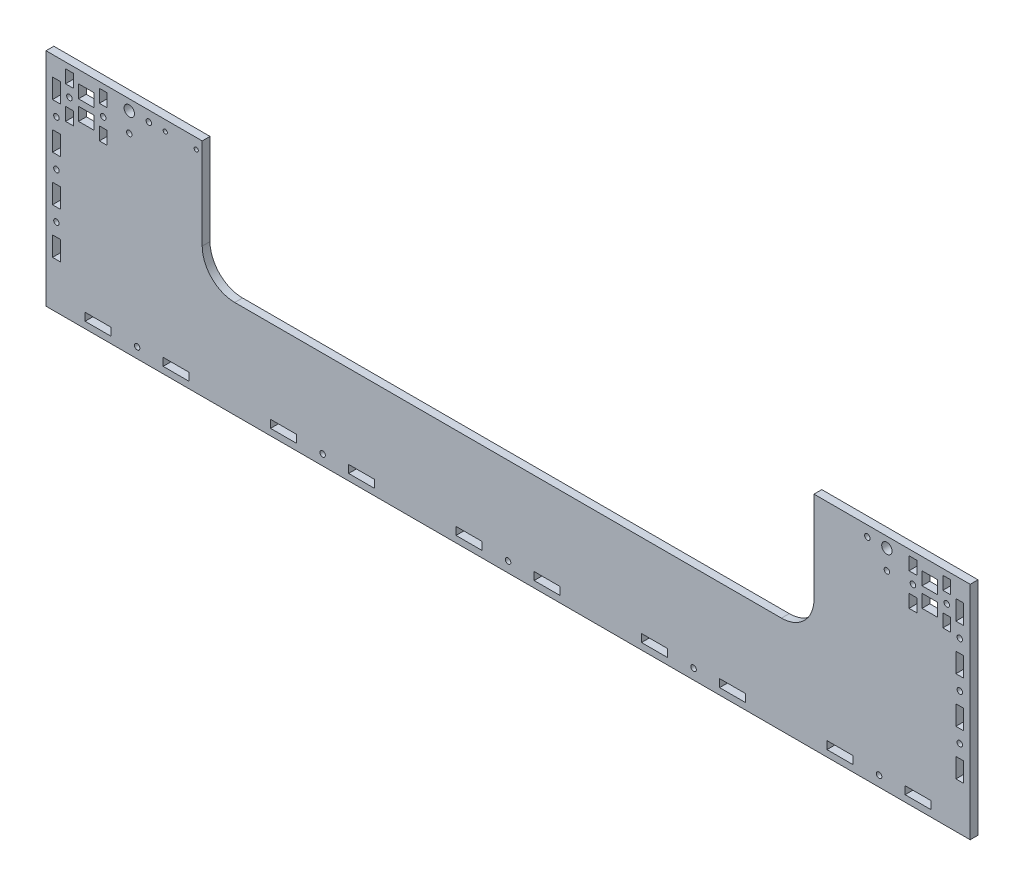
from build123d import *

# Parameters (mm, degrees)
SKETCH_2_W          = 710
SKETCH_2_H          = 170
SKETCH_2_R          = 2.1
SKETCH_2_W_2        = 6
SKETCH_2_H_2        = 15
EXTRUDE_1_DEPTH     = 6
SKETCH_3_R          = 2.1
SKETCH_3_W          = 20
SKETCH_3_H          = 6
CUT_EXTRUDE_1_DEPTH = 394.650860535
SKETCH_4_R          = 4
SKETCH_4_R_2        = 2.1
CUT_EXTRUDE_2_DEPTH = 394.650860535
CUT_EXTRUDE_3_DEPTH = 394.650860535
SKETCH_6_R          = 2.1
SKETCH_6_W          = 12
SKETCH_6_H          = 10
SKETCH_6_W_2        = 6
CUT_EXTRUDE_4_DEPTH = 394.650860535
SKETCH_7_R          = 1.6
CUT_EXTRUDE_5_DEPTH = 394.650860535


with BuildPart() as part:
    # Sketch 2 → Extrude 1 (new body)
    with BuildSketch(Plane.XY):
        with Locations((0, 85)):
            Rectangle(SKETCH_2_W, SKETCH_2_H)
        with Locations((-347, 130)):
            Circle(SKETCH_2_R, mode=Mode.SUBTRACT)
        with Locations((-347, 95)):
            Circle(SKETCH_2_R, mode=Mode.SUBTRACT)
        with Locations((-347, 60)):
            Circle(SKETCH_2_R, mode=Mode.SUBTRACT)
        with Locations(Location((347, 60, 0), (0, 0, 180))):
            Circle(SKETCH_2_R, mode=Mode.SUBTRACT)
        with Locations(Location((347, 95, 0), (0, 0, 180))):
            Circle(SKETCH_2_R, mode=Mode.SUBTRACT)
        with Locations(Location((347, 130, 0), (0, 0, 180))):
            Circle(SKETCH_2_R, mode=Mode.SUBTRACT)
        with Locations((347, 42.5)):
            Rectangle(SKETCH_2_W_2, SKETCH_2_H_2, mode=Mode.SUBTRACT)
        with Locations((-347, 147.5)):
            Rectangle(SKETCH_2_W_2, SKETCH_2_H_2, mode=Mode.SUBTRACT)
        with Locations((-347, 112.5)):
            Rectangle(SKETCH_2_W_2, SKETCH_2_H_2, mode=Mode.SUBTRACT)
        with Locations((-347, 77.5)):
            Rectangle(SKETCH_2_W_2, SKETCH_2_H_2, mode=Mode.SUBTRACT)
        with Locations((-347, 42.5)):
            Rectangle(SKETCH_2_W_2, SKETCH_2_H_2, mode=Mode.SUBTRACT)
        with Locations((347, 77.5)):
            Rectangle(SKETCH_2_W_2, SKETCH_2_H_2, mode=Mode.SUBTRACT)
        with Locations((347, 112.5)):
            Rectangle(SKETCH_2_W_2, SKETCH_2_H_2, mode=Mode.SUBTRACT)
        with Locations((347, 147.5)):
            Rectangle(SKETCH_2_W_2, SKETCH_2_H_2, mode=Mode.SUBTRACT)
    extrude(amount=EXTRUDE_1_DEPTH)

    # Sketch 3 → Cut-Extrude 1 (cut, through all)
    with BuildSketch(Plane.XY.offset(6)):
        with Locations((-285, 8)):
            Circle(SKETCH_3_R)
        with Locations((-142.5, 8)):
            Circle(SKETCH_3_R)
        with Locations((0, 8)):
            Circle(SKETCH_3_R)
        with Locations(Location((142.5, 8, 0), (0, 0, 180))):
            Circle(SKETCH_3_R)
        with Locations(Location((285, 8, 0), (0, 0, 180))):
            Circle(SKETCH_3_R)
        with Locations((-315, 8)):
            Rectangle(SKETCH_3_W, SKETCH_3_H)
        with Locations((-255, 8)):
            Rectangle(SKETCH_3_W, SKETCH_3_H)
        with Locations((-172.5, 8)):
            Rectangle(SKETCH_3_W, SKETCH_3_H)
        with Locations((-112.5, 8)):
            Rectangle(SKETCH_3_W, SKETCH_3_H)
        with Locations((-30, 8)):
            Rectangle(SKETCH_3_W, SKETCH_3_H)
        with Locations((30, 8)):
            Rectangle(SKETCH_3_W, SKETCH_3_H)
        with Locations((112.5, 8)):
            Rectangle(SKETCH_3_W, SKETCH_3_H)
        with Locations((172.5, 8)):
            Rectangle(SKETCH_3_W, SKETCH_3_H)
        with Locations((255, 8)):
            Rectangle(SKETCH_3_W, SKETCH_3_H)
        with Locations((315, 8)):
            Rectangle(SKETCH_3_W, SKETCH_3_H)
    extrude(amount=-CUT_EXTRUDE_1_DEPTH, mode=Mode.SUBTRACT)

    # Sketch 4 → Cut-Extrude 2 (cut, through all)
    with BuildSketch(Plane.XY.offset(6)):
        with Locations((-291, 162)):
            Circle(SKETCH_4_R)
        with Locations((-291, 147)):
            Circle(SKETCH_4_R_2)
        with Locations((-276, 162)):
            Circle(SKETCH_4_R_2)
        with Locations(Location((276, 162, 0), (0, 0, 180))):
            Circle(SKETCH_4_R_2)
        with Locations(Location((291, 147, 0), (0, 0, 180))):
            Circle(SKETCH_4_R_2)
        with Locations(Location((291, 162, 0), (0, 0, 180))):
            Circle(SKETCH_4_R)
    extrude(amount=-CUT_EXTRUDE_2_DEPTH, mode=Mode.SUBTRACT)

    # Sketch 5 → Cut-Extrude 3 (cut, through all)
    with BuildSketch(Plane.XY.offset(6)):
        with BuildLine():
            Line((-235, 170), (235, 170))
            Line((235, 170), (235, 100))
            ThreePointArc((235, 100), (227.67766953, 82.32233047), (210, 75))
            Line((210, 75), (-210, 75))
            ThreePointArc((-210, 75), (-227.67766953, 82.32233047), (-235, 100))
            Line((-235, 100), (-235, 170))
        make_face()
    extrude(amount=-CUT_EXTRUDE_3_DEPTH, mode=Mode.SUBTRACT)

    # Sketch 6 → Cut-Extrude 4 (cut, through all)
    with BuildSketch(Plane.XY.offset(6)):
        with Locations((-337, 148)):
            Circle(SKETCH_6_R)
        with Locations((-311, 148)):
            Circle(SKETCH_6_R)
        with Locations(Location((311, 148, 0), (0, 0, 180))):
            Circle(SKETCH_6_R)
        with Locations(Location((337, 148, 0), (0, 0, 180))):
            Circle(SKETCH_6_R)
        with Locations((-324, 155.5)):
            Rectangle(SKETCH_6_W, SKETCH_6_H)
        with Locations((-324, 140.5)):
            Rectangle(SKETCH_6_W, SKETCH_6_H)
        with Locations((-337, 160.5)):
            Rectangle(SKETCH_6_W_2, SKETCH_6_H)
        with Locations((-337, 135.5)):
            Rectangle(SKETCH_6_W_2, SKETCH_6_H)
        with Locations((-311, 160.5)):
            Rectangle(SKETCH_6_W_2, SKETCH_6_H)
        with Locations((-311, 135.5)):
            Rectangle(SKETCH_6_W_2, SKETCH_6_H)
        with Locations((311, 135.5)):
            Rectangle(SKETCH_6_W_2, SKETCH_6_H)
        with Locations((311, 160.5)):
            Rectangle(SKETCH_6_W_2, SKETCH_6_H)
        with Locations((337, 135.5)):
            Rectangle(SKETCH_6_W_2, SKETCH_6_H)
        with Locations((337, 160.5)):
            Rectangle(SKETCH_6_W_2, SKETCH_6_H)
        with Locations((324, 140.5)):
            Rectangle(SKETCH_6_W, SKETCH_6_H)
        with Locations((324, 155.5)):
            Rectangle(SKETCH_6_W, SKETCH_6_H)
    extrude(amount=-CUT_EXTRUDE_4_DEPTH, mode=Mode.SUBTRACT)

    # Sketch 7 → Cut-Extrude 5 (cut, through all)
    with BuildSketch(Plane.XY.offset(6)):
        with Locations((-239.6, 162)):
            Circle(SKETCH_7_R)
        with Locations((-263.4, 162)):
            Circle(SKETCH_7_R)
    extrude(amount=-CUT_EXTRUDE_5_DEPTH, mode=Mode.SUBTRACT)


solid = part.part
